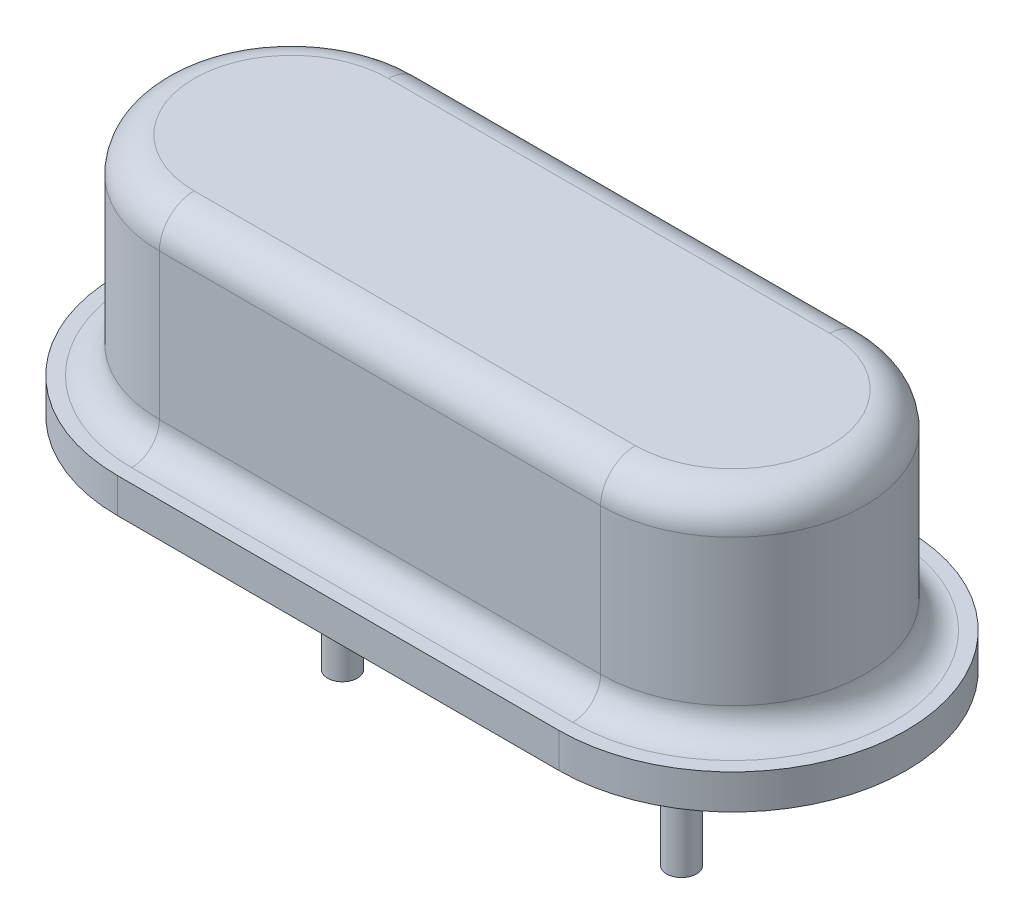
ISO-10303-21;
HEADER;
FILE_DESCRIPTION(('STEP AP214'),'2;1');
FILE_NAME('part.step','',(''),(''),'','','');
FILE_SCHEMA(('AUTOMOTIVE_DESIGN { 1 0 10303 214 1 1 1 1 }'));
ENDSEC;
DATA;
#1=APPLICATION_CONTEXT('core data for automotive mechanical design processes');
#2=APPLICATION_PROTOCOL_DEFINITION('international standard','automotive_design',2000,#1);
#3=PRODUCT_CONTEXT('',#1,'mechanical');
#4=PRODUCT('Part','Part','',(#3));
#5=PRODUCT_RELATED_PRODUCT_CATEGORY('part','',(#4));
#6=PRODUCT_DEFINITION_FORMATION('','',#4);
#7=PRODUCT_DEFINITION_CONTEXT('part definition',#1,'design');
#8=PRODUCT_DEFINITION('design','',#6,#7);
#9=PRODUCT_DEFINITION_SHAPE('','',#8);
#10=(LENGTH_UNIT() NAMED_UNIT(*) SI_UNIT(.MILLI.,.METRE.));
#11=(NAMED_UNIT(*) PLANE_ANGLE_UNIT() SI_UNIT($,.RADIAN.));
#12=(NAMED_UNIT(*) SI_UNIT($,.STERADIAN.) SOLID_ANGLE_UNIT());
#13=UNCERTAINTY_MEASURE_WITH_UNIT(LENGTH_MEASURE(1.E-05),#10,'distance_accuracy_value','');
#14=(GEOMETRIC_REPRESENTATION_CONTEXT(3) GLOBAL_UNCERTAINTY_ASSIGNED_CONTEXT((#13)) GLOBAL_UNIT_ASSIGNED_CONTEXT((#10,
#11,#12)) REPRESENTATION_CONTEXT('',''));
#15=CARTESIAN_POINT('',(0.,0.,0.));
#16=DIRECTION('',(0.,0.,1.));
#17=DIRECTION('',(1.,0.,0.));
#18=AXIS2_PLACEMENT_3D('',#15,#16,#17);
#19=CARTESIAN_POINT('',(-0.734999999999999,0.8,0.));
#20=DIRECTION('',(0.,-1.,0.));
#21=DIRECTION('',(0.,0.,-1.));
#22=AXIS2_PLACEMENT_3D('',#19,#20,#21);
#23=PLANE('',#22);
#24=DIRECTION('',(1.,0.,0.));
#25=VECTOR('',#24,1.);
#26=CARTESIAN_POINT('',(-0.734999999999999,0.8,2.3));
#27=LINE('',#26,#25);
#28=CARTESIAN_POINT('',(5.615,0.8,2.3));
#29=VERTEX_POINT('',#28);
#30=CARTESIAN_POINT('',(-0.734999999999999,0.8,2.3));
#31=VERTEX_POINT('',#30);
#32=EDGE_CURVE('E210',#29,#31,#27,.F.);
#33=ORIENTED_EDGE('',*,*,#32,.T.);
#34=CARTESIAN_POINT('',(-0.734999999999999,0.8,0.));
#35=DIRECTION('',(0.,-1.,0.));
#36=DIRECTION('',(0.,0.,-1.));
#37=AXIS2_PLACEMENT_3D('',#34,#35,#36);
#38=CIRCLE('',#37,2.3);
#39=CARTESIAN_POINT('',(-0.735,0.8,-2.3));
#40=VERTEX_POINT('',#39);
#41=EDGE_CURVE('E218',#31,#40,#38,.T.);
#42=ORIENTED_EDGE('',*,*,#41,.T.);
#43=DIRECTION('',(-1.,0.,0.));
#44=VECTOR('',#43,1.);
#45=CARTESIAN_POINT('',(5.615,0.8,-2.3));
#46=LINE('',#45,#44);
#47=CARTESIAN_POINT('',(5.615,0.8,-2.3));
#48=VERTEX_POINT('',#47);
#49=EDGE_CURVE('E216',#40,#48,#46,.F.);
#50=ORIENTED_EDGE('',*,*,#49,.T.);
#51=CARTESIAN_POINT('',(5.615,0.8,0.));
#52=DIRECTION('',(0.,-1.,0.));
#53=DIRECTION('',(0.,0.,-1.));
#54=AXIS2_PLACEMENT_3D('',#51,#52,#53);
#55=CIRCLE('',#54,2.3);
#56=EDGE_CURVE('E213',#48,#29,#55,.T.);
#57=ORIENTED_EDGE('',*,*,#56,.T.);
#58=EDGE_LOOP('',(#33,#42,#50,#57));
#59=FACE_BOUND('',#58,.T.);
#60=CARTESIAN_POINT('',(-0.734999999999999,0.8,0.));
#61=DIRECTION('',(0.,1.,0.));
#62=DIRECTION('',(0.,0.,-1.));
#63=AXIS2_PLACEMENT_3D('',#60,#61,#62);
#64=CIRCLE('',#63,2.5);
#65=CARTESIAN_POINT('',(-0.734999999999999,0.8,-2.5));
#66=VERTEX_POINT('',#65);
#67=CARTESIAN_POINT('',(-0.734999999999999,0.8,2.5));
#68=VERTEX_POINT('',#67);
#69=EDGE_CURVE('E168',#66,#68,#64,.T.);
#70=ORIENTED_EDGE('',*,*,#69,.T.);
#71=DIRECTION('',(1.,0.,0.));
#72=VECTOR('',#71,1.);
#73=CARTESIAN_POINT('',(-0.734999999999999,0.8,2.5));
#74=LINE('',#73,#72);
#75=CARTESIAN_POINT('',(5.615,0.8,2.5));
#76=VERTEX_POINT('',#75);
#77=EDGE_CURVE('E141',#68,#76,#74,.T.);
#78=ORIENTED_EDGE('',*,*,#77,.T.);
#79=CARTESIAN_POINT('',(5.615,0.8,0.));
#80=DIRECTION('',(0.,1.,0.));
#81=DIRECTION('',(0.,0.,1.));
#82=AXIS2_PLACEMENT_3D('',#79,#80,#81);
#83=CIRCLE('',#82,2.5);
#84=CARTESIAN_POINT('',(5.615,0.8,-2.5));
#85=VERTEX_POINT('',#84);
#86=EDGE_CURVE('E173',#76,#85,#83,.T.);
#87=ORIENTED_EDGE('',*,*,#86,.T.);
#88=DIRECTION('',(-1.,0.,0.));
#89=VECTOR('',#88,1.);
#90=CARTESIAN_POINT('',(-0.734999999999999,0.8,-2.5));
#91=LINE('',#90,#89);
#92=EDGE_CURVE('E176',#85,#66,#91,.T.);
#93=ORIENTED_EDGE('',*,*,#92,.T.);
#94=EDGE_LOOP('',(#70,#78,#87,#93));
#95=FACE_BOUND('',#94,.T.);
#96=ADVANCED_FACE('F38',(#59,#95),#23,.F.);
#97=CARTESIAN_POINT('',(0.,-2.5,0.));
#98=DIRECTION('',(0.,-1.,0.));
#99=DIRECTION('',(1.,0.,0.));
#100=AXIS2_PLACEMENT_3D('',#97,#98,#99);
#101=PLANE('',#100);
#102=CARTESIAN_POINT('',(0.,-2.5,0.));
#103=DIRECTION('',(0.,-1.,0.));
#104=DIRECTION('',(1.,0.,0.));
#105=AXIS2_PLACEMENT_3D('',#102,#103,#104);
#106=CIRCLE('',#105,0.215);
#107=CARTESIAN_POINT('',(0.215,-2.5,0.));
#108=VERTEX_POINT('',#107);
#109=EDGE_CURVE('E198',#108,#108,#106,.T.);
#110=ORIENTED_EDGE('',*,*,#109,.T.);
#111=EDGE_LOOP('',(#110));
#112=FACE_BOUND('',#111,.T.);
#113=ADVANCED_FACE('F40',(#112),#101,.T.);
#114=CARTESIAN_POINT('',(0.,-2.5,0.));
#115=DIRECTION('',(0.,-1.,0.));
#116=DIRECTION('',(1.,0.,0.));
#117=AXIS2_PLACEMENT_3D('',#114,#115,#116);
#118=CYLINDRICAL_SURFACE('',#117,0.215);
#119=CARTESIAN_POINT('',(0.,0.,0.));
#120=DIRECTION('',(0.,-1.,0.));
#121=DIRECTION('',(1.,0.,0.));
#122=AXIS2_PLACEMENT_3D('',#119,#120,#121);
#123=CIRCLE('',#122,0.215);
#124=CARTESIAN_POINT('',(0.215,0.,0.));
#125=VERTEX_POINT('',#124);
#126=EDGE_CURVE('E194',#125,#125,#123,.T.);
#127=ORIENTED_EDGE('',*,*,#126,.T.);
#128=EDGE_LOOP('',(#127));
#129=FACE_BOUND('',#128,.T.);
#130=ORIENTED_EDGE('',*,*,#109,.F.);
#131=EDGE_LOOP('',(#130));
#132=FACE_BOUND('',#131,.T.);
#133=ADVANCED_FACE('F367',(#129,#132),#118,.T.);
#134=CARTESIAN_POINT('',(0.215,0.,0.));
#135=DIRECTION('',(0.,-1.,0.));
#136=DIRECTION('',(1.,0.,0.));
#137=AXIS2_PLACEMENT_3D('',#134,#135,#136);
#138=PLANE('',#137);
#139=CARTESIAN_POINT('',(0.,0.,0.));
#140=DIRECTION('',(0.,-1.,0.));
#141=DIRECTION('',(1.,0.,0.));
#142=AXIS2_PLACEMENT_3D('',#139,#140,#141);
#143=CIRCLE('',#142,0.312701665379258);
#144=CARTESIAN_POINT('',(0.312701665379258,0.,0.));
#145=VERTEX_POINT('',#144);
#146=EDGE_CURVE('E190',#145,#145,#143,.T.);
#147=ORIENTED_EDGE('',*,*,#146,.T.);
#148=EDGE_LOOP('',(#147));
#149=FACE_BOUND('',#148,.T.);
#150=ORIENTED_EDGE('',*,*,#126,.F.);
#151=EDGE_LOOP('',(#150));
#152=FACE_BOUND('',#151,.T.);
#153=ADVANCED_FACE('F385',(#149,#152),#138,.T.);
#154=CARTESIAN_POINT('',(0.,0.4,0.));
#155=DIRECTION('',(0.,-1.,0.));
#156=DIRECTION('',(1.,0.,0.));
#157=AXIS2_PLACEMENT_3D('',#154,#155,#156);
#158=DEGENERATE_TOROIDAL_SURFACE('',#157,0.312701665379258,0.4,.T.);
#159=CARTESIAN_POINT('',(0.,0.3,0.));
#160=DIRECTION('',(0.,-1.,0.));
#161=DIRECTION('',(0.,0.,-1.));
#162=AXIS2_PLACEMENT_3D('',#159,#160,#161);
#163=CIRCLE('',#162,0.7);
#164=CARTESIAN_POINT('',(0.,0.3,-0.7));
#165=VERTEX_POINT('',#164);
#166=EDGE_CURVE('E146',#165,#165,#163,.F.);
#167=ORIENTED_EDGE('',*,*,#166,.F.);
#168=EDGE_LOOP('',(#167));
#169=FACE_BOUND('',#168,.T.);
#170=ORIENTED_EDGE('',*,*,#146,.F.);
#171=EDGE_LOOP('',(#170));
#172=FACE_BOUND('',#171,.T.);
#173=ADVANCED_FACE('F382',(#169,#172),#158,.T.);
#174=CARTESIAN_POINT('',(-0.734999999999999,0.8,0.));
#175=DIRECTION('',(0.,-1.,0.));
#176=DIRECTION('',(0.,0.,-1.));
#177=AXIS2_PLACEMENT_3D('',#174,#175,#176);
#178=CYLINDRICAL_SURFACE('',#177,2.5);
#179=CARTESIAN_POINT('',(-0.734999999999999,0.3,0.));
#180=DIRECTION('',(0.,1.,0.));
#181=DIRECTION('',(0.,0.,-1.));
#182=AXIS2_PLACEMENT_3D('',#179,#180,#181);
#183=CIRCLE('',#182,2.5);
#184=CARTESIAN_POINT('',(-0.734999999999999,0.3,-2.5));
#185=VERTEX_POINT('',#184);
#186=CARTESIAN_POINT('',(-0.734999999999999,0.3,2.5));
#187=VERTEX_POINT('',#186);
#188=EDGE_CURVE('E131',#185,#187,#183,.T.);
#189=ORIENTED_EDGE('',*,*,#188,.T.);
#190=DIRECTION('',(0.,-1.,0.));
#191=VECTOR('',#190,1.);
#192=CARTESIAN_POINT('',(-0.734999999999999,0.8,2.5));
#193=LINE('',#192,#191);
#194=EDGE_CURVE('E139',#68,#187,#193,.T.);
#195=ORIENTED_EDGE('',*,*,#194,.F.);
#196=ORIENTED_EDGE('',*,*,#69,.F.);
#197=DIRECTION('',(0.,-1.,0.));
#198=VECTOR('',#197,1.);
#199=CARTESIAN_POINT('',(-0.734999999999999,0.8,-2.5));
#200=LINE('',#199,#198);
#201=EDGE_CURVE('E152',#66,#185,#200,.T.);
#202=ORIENTED_EDGE('',*,*,#201,.T.);
#203=EDGE_LOOP('',(#189,#195,#196,#202));
#204=FACE_BOUND('',#203,.T.);
#205=ADVANCED_FACE('F150',(#204),#178,.T.);
#206=CARTESIAN_POINT('',(-0.734999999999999,0.8,2.5));
#207=DIRECTION('',(0.,0.,-1.));
#208=DIRECTION('',(-1.,0.,0.));
#209=AXIS2_PLACEMENT_3D('',#206,#207,#208);
#210=PLANE('',#209);
#211=DIRECTION('',(1.,0.,0.));
#212=VECTOR('',#211,1.);
#213=CARTESIAN_POINT('',(-0.734999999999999,0.3,2.5));
#214=LINE('',#213,#212);
#215=CARTESIAN_POINT('',(5.615,0.3,2.5));
#216=VERTEX_POINT('',#215);
#217=EDGE_CURVE('E126',#187,#216,#214,.T.);
#218=ORIENTED_EDGE('',*,*,#217,.T.);
#219=DIRECTION('',(0.,-1.,0.));
#220=VECTOR('',#219,1.);
#221=CARTESIAN_POINT('',(5.615,0.8,2.5));
#222=LINE('',#221,#220);
#223=EDGE_CURVE('E147',#76,#216,#222,.T.);
#224=ORIENTED_EDGE('',*,*,#223,.F.);
#225=ORIENTED_EDGE('',*,*,#77,.F.);
#226=ORIENTED_EDGE('',*,*,#194,.T.);
#227=EDGE_LOOP('',(#218,#224,#225,#226));
#228=FACE_BOUND('',#227,.T.);
#229=ADVANCED_FACE('F140',(#228),#210,.F.);
#230=CARTESIAN_POINT('',(5.615,0.8,0.));
#231=DIRECTION('',(0.,-1.,0.));
#232=DIRECTION('',(0.,0.,-1.));
#233=AXIS2_PLACEMENT_3D('',#230,#231,#232);
#234=CYLINDRICAL_SURFACE('',#233,2.5);
#235=CARTESIAN_POINT('',(5.615,0.3,0.));
#236=DIRECTION('',(0.,1.,0.));
#237=DIRECTION('',(0.,0.,1.));
#238=AXIS2_PLACEMENT_3D('',#235,#236,#237);
#239=CIRCLE('',#238,2.5);
#240=CARTESIAN_POINT('',(5.615,0.3,-2.5));
#241=VERTEX_POINT('',#240);
#242=EDGE_CURVE('E132',#216,#241,#239,.T.);
#243=ORIENTED_EDGE('',*,*,#242,.T.);
#244=DIRECTION('',(0.,-1.,0.));
#245=VECTOR('',#244,1.);
#246=CARTESIAN_POINT('',(5.615,0.8,-2.5));
#247=LINE('',#246,#245);
#248=EDGE_CURVE('E181',#85,#241,#247,.T.);
#249=ORIENTED_EDGE('',*,*,#248,.F.);
#250=ORIENTED_EDGE('',*,*,#86,.F.);
#251=ORIENTED_EDGE('',*,*,#223,.T.);
#252=EDGE_LOOP('',(#243,#249,#250,#251));
#253=FACE_BOUND('',#252,.T.);
#254=ADVANCED_FACE('F373',(#253),#234,.T.);
#255=CARTESIAN_POINT('',(-0.734999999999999,0.8,-2.5));
#256=DIRECTION('',(0.,0.,1.));
#257=DIRECTION('',(1.,0.,0.));
#258=AXIS2_PLACEMENT_3D('',#255,#256,#257);
#259=PLANE('',#258);
#260=DIRECTION('',(-1.,0.,0.));
#261=VECTOR('',#260,1.);
#262=CARTESIAN_POINT('',(-0.734999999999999,0.3,-2.5));
#263=LINE('',#262,#261);
#264=EDGE_CURVE('E165',#241,#185,#263,.T.);
#265=ORIENTED_EDGE('',*,*,#264,.T.);
#266=ORIENTED_EDGE('',*,*,#201,.F.);
#267=ORIENTED_EDGE('',*,*,#92,.F.);
#268=ORIENTED_EDGE('',*,*,#248,.T.);
#269=EDGE_LOOP('',(#265,#266,#267,#268));
#270=FACE_BOUND('',#269,.T.);
#271=ADVANCED_FACE('F370',(#270),#259,.F.);
#272=CARTESIAN_POINT('',(-0.734999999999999,0.3,0.));
#273=DIRECTION('',(0.,-1.,0.));
#274=DIRECTION('',(0.,0.,-1.));
#275=AXIS2_PLACEMENT_3D('',#272,#273,#274);
#276=PLANE('',#275);
#277=CARTESIAN_POINT('',(4.88,0.3,0.));
#278=DIRECTION('',(0.,-1.,0.));
#279=DIRECTION('',(0.,0.,-1.));
#280=AXIS2_PLACEMENT_3D('',#277,#278,#279);
#281=CIRCLE('',#280,0.7);
#282=CARTESIAN_POINT('',(4.88,0.3,-0.7));
#283=VERTEX_POINT('',#282);
#284=EDGE_CURVE('E202',#283,#283,#281,.T.);
#285=ORIENTED_EDGE('',*,*,#284,.F.);
#286=EDGE_LOOP('',(#285));
#287=FACE_BOUND('',#286,.T.);
#288=ORIENTED_EDGE('',*,*,#166,.T.);
#289=EDGE_LOOP('',(#288));
#290=FACE_BOUND('',#289,.T.);
#291=ORIENTED_EDGE('',*,*,#188,.F.);
#292=ORIENTED_EDGE('',*,*,#264,.F.);
#293=ORIENTED_EDGE('',*,*,#242,.F.);
#294=ORIENTED_EDGE('',*,*,#217,.F.);
#295=EDGE_LOOP('',(#291,#292,#293,#294));
#296=FACE_BOUND('',#295,.T.);
#297=ADVANCED_FACE('F128',(#287,#290,#296),#276,.T.);
#298=CARTESIAN_POINT('',(5.615,18.1380118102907,-1.9));
#299=DIRECTION('',(0.,0.,1.));
#300=DIRECTION('',(1.,0.,0.));
#301=AXIS2_PLACEMENT_3D('',#298,#299,#300);
#302=PLANE('',#301);
#303=DIRECTION('',(0.,-1.,0.));
#304=VECTOR('',#303,1.);
#305=CARTESIAN_POINT('',(-0.734999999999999,18.1380118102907,-1.9));
#306=LINE('',#305,#304);
#307=CARTESIAN_POINT('',(-0.734999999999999,3.3,-1.9));
#308=VERTEX_POINT('',#307);
#309=CARTESIAN_POINT('',(-0.734999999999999,1.20000000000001,-1.9));
#310=VERTEX_POINT('',#309);
#311=EDGE_CURVE('E267',#308,#310,#306,.T.);
#312=ORIENTED_EDGE('',*,*,#311,.F.);
#313=DIRECTION('',(1.,0.,0.));
#314=VECTOR('',#313,1.);
#315=CARTESIAN_POINT('',(5.615,3.3,-1.9));
#316=LINE('',#315,#314);
#317=CARTESIAN_POINT('',(5.615,3.3,-1.9));
#318=VERTEX_POINT('',#317);
#319=EDGE_CURVE('E251',#308,#318,#316,.T.);
#320=ORIENTED_EDGE('',*,*,#319,.T.);
#321=DIRECTION('',(0.,-1.,0.));
#322=VECTOR('',#321,1.);
#323=CARTESIAN_POINT('',(5.615,18.1380118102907,-1.9));
#324=LINE('',#323,#322);
#325=CARTESIAN_POINT('',(5.615,1.20000000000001,-1.9));
#326=VERTEX_POINT('',#325);
#327=EDGE_CURVE('E268',#318,#326,#324,.T.);
#328=ORIENTED_EDGE('',*,*,#327,.T.);
#329=DIRECTION('',(-1.,0.,0.));
#330=VECTOR('',#329,1.);
#331=CARTESIAN_POINT('',(-0.735,1.2,-1.9));
#332=LINE('',#331,#330);
#333=EDGE_CURVE('E222',#326,#310,#332,.T.);
#334=ORIENTED_EDGE('',*,*,#333,.T.);
#335=EDGE_LOOP('',(#312,#320,#328,#334));
#336=FACE_BOUND('',#335,.T.);
#337=ADVANCED_FACE('F350',(#336),#302,.F.);
#338=CARTESIAN_POINT('',(5.615,18.1380118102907,0.));
#339=DIRECTION('',(0.,-1.,0.));
#340=DIRECTION('',(0.,0.,-1.));
#341=AXIS2_PLACEMENT_3D('',#338,#339,#340);
#342=CYLINDRICAL_SURFACE('',#341,1.9);
#343=ORIENTED_EDGE('',*,*,#327,.F.);
#344=CARTESIAN_POINT('',(5.615,3.3,0.));
#345=DIRECTION('',(0.,-1.,0.));
#346=DIRECTION('',(0.,0.,-1.));
#347=AXIS2_PLACEMENT_3D('',#344,#345,#346);
#348=CIRCLE('',#347,1.9);
#349=CARTESIAN_POINT('',(5.615,3.3,1.9));
#350=VERTEX_POINT('',#349);
#351=EDGE_CURVE('E234',#318,#350,#348,.T.);
#352=ORIENTED_EDGE('',*,*,#351,.T.);
#353=DIRECTION('',(0.,-1.,0.));
#354=VECTOR('',#353,1.);
#355=CARTESIAN_POINT('',(5.615,18.1380118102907,1.9));
#356=LINE('',#355,#354);
#357=CARTESIAN_POINT('',(5.615,1.20000000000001,1.9));
#358=VERTEX_POINT('',#357);
#359=EDGE_CURVE('E159',#350,#358,#356,.T.);
#360=ORIENTED_EDGE('',*,*,#359,.T.);
#361=CARTESIAN_POINT('',(5.615,1.2,0.));
#362=DIRECTION('',(0.,-1.,0.));
#363=DIRECTION('',(0.,0.,-1.));
#364=AXIS2_PLACEMENT_3D('',#361,#362,#363);
#365=CIRCLE('',#364,1.9);
#366=EDGE_CURVE('E226',#358,#326,#365,.F.);
#367=ORIENTED_EDGE('',*,*,#366,.T.);
#368=EDGE_LOOP('',(#343,#352,#360,#367));
#369=FACE_BOUND('',#368,.T.);
#370=ADVANCED_FACE('F325',(#369),#342,.T.);
#371=CARTESIAN_POINT('',(-0.734999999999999,18.1380118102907,1.9));
#372=DIRECTION('',(0.,0.,-1.));
#373=DIRECTION('',(-1.,0.,0.));
#374=AXIS2_PLACEMENT_3D('',#371,#372,#373);
#375=PLANE('',#374);
#376=ORIENTED_EDGE('',*,*,#359,.F.);
#377=DIRECTION('',(-1.,0.,0.));
#378=VECTOR('',#377,1.);
#379=CARTESIAN_POINT('',(-0.734999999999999,3.3,1.9));
#380=LINE('',#379,#378);
#381=CARTESIAN_POINT('',(-0.734999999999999,3.3,1.9));
#382=VERTEX_POINT('',#381);
#383=EDGE_CURVE('E12',#350,#382,#380,.T.);
#384=ORIENTED_EDGE('',*,*,#383,.T.);
#385=DIRECTION('',(0.,-1.,0.));
#386=VECTOR('',#385,1.);
#387=CARTESIAN_POINT('',(-0.734999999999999,18.1380118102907,1.9));
#388=LINE('',#387,#386);
#389=CARTESIAN_POINT('',(-0.734999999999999,1.20000000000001,1.9));
#390=VERTEX_POINT('',#389);
#391=EDGE_CURVE('E154',#382,#390,#388,.T.);
#392=ORIENTED_EDGE('',*,*,#391,.T.);
#393=DIRECTION('',(1.,0.,0.));
#394=VECTOR('',#393,1.);
#395=CARTESIAN_POINT('',(5.615,1.2,1.9));
#396=LINE('',#395,#394);
#397=EDGE_CURVE('E230',#390,#358,#396,.T.);
#398=ORIENTED_EDGE('',*,*,#397,.T.);
#399=EDGE_LOOP('',(#376,#384,#392,#398));
#400=FACE_BOUND('',#399,.T.);
#401=ADVANCED_FACE('F326',(#400),#375,.F.);
#402=CARTESIAN_POINT('',(-0.734999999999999,18.1380118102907,0.));
#403=DIRECTION('',(0.,-1.,0.));
#404=DIRECTION('',(0.,0.,-1.));
#405=AXIS2_PLACEMENT_3D('',#402,#403,#404);
#406=CYLINDRICAL_SURFACE('',#405,1.9);
#407=ORIENTED_EDGE('',*,*,#391,.F.);
#408=CARTESIAN_POINT('',(-0.734999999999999,3.3,0.));
#409=DIRECTION('',(0.,-1.,0.));
#410=DIRECTION('',(0.,0.,-1.));
#411=AXIS2_PLACEMENT_3D('',#408,#409,#410);
#412=CIRCLE('',#411,1.9);
#413=EDGE_CURVE('E47',#382,#308,#412,.T.);
#414=ORIENTED_EDGE('',*,*,#413,.T.);
#415=ORIENTED_EDGE('',*,*,#311,.T.);
#416=CARTESIAN_POINT('',(-0.734999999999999,1.2,0.));
#417=DIRECTION('',(0.,-1.,0.));
#418=DIRECTION('',(0.,0.,-1.));
#419=AXIS2_PLACEMENT_3D('',#416,#417,#418);
#420=CIRCLE('',#419,1.9);
#421=EDGE_CURVE('E206',#310,#390,#420,.F.);
#422=ORIENTED_EDGE('',*,*,#421,.T.);
#423=EDGE_LOOP('',(#407,#414,#415,#422));
#424=FACE_BOUND('',#423,.T.);
#425=ADVANCED_FACE('F351',(#424),#406,.T.);
#426=CARTESIAN_POINT('',(-0.734999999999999,3.8,0.));
#427=DIRECTION('',(0.,-1.,0.));
#428=DIRECTION('',(0.,0.,-1.));
#429=AXIS2_PLACEMENT_3D('',#426,#427,#428);
#430=PLANE('',#429);
#431=DIRECTION('',(-1.,0.,0.));
#432=VECTOR('',#431,1.);
#433=CARTESIAN_POINT('',(-0.734999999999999,3.8,1.4));
#434=LINE('',#433,#432);
#435=CARTESIAN_POINT('',(-0.734999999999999,3.8,1.4));
#436=VERTEX_POINT('',#435);
#437=CARTESIAN_POINT('',(5.615,3.8,1.4));
#438=VERTEX_POINT('',#437);
#439=EDGE_CURVE('E238',#436,#438,#434,.F.);
#440=ORIENTED_EDGE('',*,*,#439,.T.);
#441=CARTESIAN_POINT('',(5.615,3.8,0.));
#442=DIRECTION('',(0.,-1.,0.));
#443=DIRECTION('',(0.,0.,-1.));
#444=AXIS2_PLACEMENT_3D('',#441,#442,#443);
#445=CIRCLE('',#444,1.4);
#446=CARTESIAN_POINT('',(5.615,3.8,-1.4));
#447=VERTEX_POINT('',#446);
#448=EDGE_CURVE('E247',#438,#447,#445,.F.);
#449=ORIENTED_EDGE('',*,*,#448,.T.);
#450=DIRECTION('',(1.,0.,0.));
#451=VECTOR('',#450,1.);
#452=CARTESIAN_POINT('',(-0.734999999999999,3.8,-1.4));
#453=LINE('',#452,#451);
#454=CARTESIAN_POINT('',(-0.734999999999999,3.8,-1.4));
#455=VERTEX_POINT('',#454);
#456=EDGE_CURVE('E244',#447,#455,#453,.F.);
#457=ORIENTED_EDGE('',*,*,#456,.T.);
#458=CARTESIAN_POINT('',(-0.734999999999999,3.8,0.));
#459=DIRECTION('',(0.,-1.,0.));
#460=DIRECTION('',(0.,0.,-1.));
#461=AXIS2_PLACEMENT_3D('',#458,#459,#460);
#462=CIRCLE('',#461,1.4);
#463=EDGE_CURVE('E241',#455,#436,#462,.F.);
#464=ORIENTED_EDGE('',*,*,#463,.T.);
#465=EDGE_LOOP('',(#440,#449,#457,#464));
#466=FACE_BOUND('',#465,.T.);
#467=ADVANCED_FACE('F315',(#466),#430,.F.);
#468=CARTESIAN_POINT('',(4.88,-2.5,0.));
#469=DIRECTION('',(0.,-1.,0.));
#470=DIRECTION('',(-1.,0.,0.));
#471=AXIS2_PLACEMENT_3D('',#468,#469,#470);
#472=PLANE('',#471);
#473=CARTESIAN_POINT('',(4.88,-2.5,0.));
#474=DIRECTION('',(0.,1.,0.));
#475=DIRECTION('',(-1.,0.,0.));
#476=AXIS2_PLACEMENT_3D('',#473,#474,#475);
#477=CIRCLE('',#476,0.215);
#478=CARTESIAN_POINT('',(4.665,-2.5,0.));
#479=VERTEX_POINT('',#478);
#480=EDGE_CURVE('E269',#479,#479,#477,.T.);
#481=ORIENTED_EDGE('',*,*,#480,.F.);
#482=EDGE_LOOP('',(#481));
#483=FACE_BOUND('',#482,.T.);
#484=ADVANCED_FACE('F358',(#483),#472,.T.);
#485=CARTESIAN_POINT('',(4.88,-2.5,0.));
#486=DIRECTION('',(0.,-1.,0.));
#487=DIRECTION('',(-1.,0.,0.));
#488=AXIS2_PLACEMENT_3D('',#485,#486,#487);
#489=CYLINDRICAL_SURFACE('',#488,0.215);
#490=CARTESIAN_POINT('',(4.88,0.,0.));
#491=DIRECTION('',(0.,1.,0.));
#492=DIRECTION('',(-1.,0.,0.));
#493=AXIS2_PLACEMENT_3D('',#490,#491,#492);
#494=CIRCLE('',#493,0.215);
#495=CARTESIAN_POINT('',(4.665,0.,0.));
#496=VERTEX_POINT('',#495);
#497=EDGE_CURVE('E278',#496,#496,#494,.T.);
#498=ORIENTED_EDGE('',*,*,#497,.F.);
#499=EDGE_LOOP('',(#498));
#500=FACE_BOUND('',#499,.T.);
#501=ORIENTED_EDGE('',*,*,#480,.T.);
#502=EDGE_LOOP('',(#501));
#503=FACE_BOUND('',#502,.T.);
#504=ADVANCED_FACE('F451',(#500,#503),#489,.T.);
#505=CARTESIAN_POINT('',(4.665,0.,0.));
#506=DIRECTION('',(0.,-1.,0.));
#507=DIRECTION('',(-1.,0.,0.));
#508=AXIS2_PLACEMENT_3D('',#505,#506,#507);
#509=PLANE('',#508);
#510=CARTESIAN_POINT('',(4.88,0.,0.));
#511=DIRECTION('',(0.,1.,0.));
#512=DIRECTION('',(-1.,0.,0.));
#513=AXIS2_PLACEMENT_3D('',#510,#511,#512);
#514=CIRCLE('',#513,0.312701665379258);
#515=CARTESIAN_POINT('',(4.56729833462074,0.,0.));
#516=VERTEX_POINT('',#515);
#517=EDGE_CURVE('E282',#516,#516,#514,.T.);
#518=ORIENTED_EDGE('',*,*,#517,.F.);
#519=EDGE_LOOP('',(#518));
#520=FACE_BOUND('',#519,.T.);
#521=ORIENTED_EDGE('',*,*,#497,.T.);
#522=EDGE_LOOP('',(#521));
#523=FACE_BOUND('',#522,.T.);
#524=ADVANCED_FACE('F460',(#520,#523),#509,.T.);
#525=CARTESIAN_POINT('',(4.88,0.4,0.));
#526=DIRECTION('',(0.,-1.,0.));
#527=DIRECTION('',(-1.,0.,0.));
#528=AXIS2_PLACEMENT_3D('',#525,#526,#527);
#529=DEGENERATE_TOROIDAL_SURFACE('',#528,0.312701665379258,0.4,.T.);
#530=ORIENTED_EDGE('',*,*,#284,.T.);
#531=EDGE_LOOP('',(#530));
#532=FACE_BOUND('',#531,.T.);
#533=ORIENTED_EDGE('',*,*,#517,.T.);
#534=EDGE_LOOP('',(#533));
#535=FACE_BOUND('',#534,.T.);
#536=ADVANCED_FACE('F469',(#532,#535),#529,.T.);
#537=CARTESIAN_POINT('',(5.615,1.2,0.));
#538=DIRECTION('',(0.,-1.,0.));
#539=DIRECTION('',(0.,0.,-1.));
#540=AXIS2_PLACEMENT_3D('',#537,#538,#539);
#541=TOROIDAL_SURFACE('',#540,2.3,0.4);
#542=CARTESIAN_POINT('',(5.615,1.2,2.3));
#543=DIRECTION('',(1.,0.,0.));
#544=DIRECTION('',(0.,0.,-1.));
#545=AXIS2_PLACEMENT_3D('',#542,#543,#544);
#546=CIRCLE('',#545,0.4);
#547=EDGE_CURVE('E260',#29,#358,#546,.T.);
#548=ORIENTED_EDGE('',*,*,#547,.F.);
#549=ORIENTED_EDGE('',*,*,#56,.F.);
#550=CARTESIAN_POINT('',(5.615,1.2,-2.3));
#551=DIRECTION('',(1.,0.,0.));
#552=DIRECTION('',(0.,0.,-1.));
#553=AXIS2_PLACEMENT_3D('',#550,#551,#552);
#554=CIRCLE('',#553,0.4);
#555=EDGE_CURVE('E288',#326,#48,#554,.T.);
#556=ORIENTED_EDGE('',*,*,#555,.F.);
#557=ORIENTED_EDGE('',*,*,#366,.F.);
#558=EDGE_LOOP('',(#548,#549,#556,#557));
#559=FACE_BOUND('',#558,.T.);
#560=ADVANCED_FACE('F334',(#559),#541,.F.);
#561=CARTESIAN_POINT('',(5.615,1.2,-2.3));
#562=DIRECTION('',(1.,0.,0.));
#563=DIRECTION('',(0.,0.,-1.));
#564=AXIS2_PLACEMENT_3D('',#561,#562,#563);
#565=CYLINDRICAL_SURFACE('',#564,0.4);
#566=ORIENTED_EDGE('',*,*,#555,.T.);
#567=ORIENTED_EDGE('',*,*,#49,.F.);
#568=CARTESIAN_POINT('',(-0.734999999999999,1.2,-2.3));
#569=DIRECTION('',(1.,0.,0.));
#570=DIRECTION('',(0.,1.,0.));
#571=AXIS2_PLACEMENT_3D('',#568,#569,#570);
#572=CIRCLE('',#571,0.4);
#573=EDGE_CURVE('E259',#310,#40,#572,.T.);
#574=ORIENTED_EDGE('',*,*,#573,.F.);
#575=ORIENTED_EDGE('',*,*,#333,.F.);
#576=EDGE_LOOP('',(#566,#567,#574,#575));
#577=FACE_BOUND('',#576,.T.);
#578=ADVANCED_FACE('F348',(#577),#565,.F.);
#579=CARTESIAN_POINT('',(-0.734999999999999,1.2,2.3));
#580=DIRECTION('',(-1.,0.,0.));
#581=DIRECTION('',(0.,0.,1.));
#582=AXIS2_PLACEMENT_3D('',#579,#580,#581);
#583=CYLINDRICAL_SURFACE('',#582,0.4);
#584=ORIENTED_EDGE('',*,*,#547,.T.);
#585=ORIENTED_EDGE('',*,*,#397,.F.);
#586=CARTESIAN_POINT('',(-0.734999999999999,1.2,2.3));
#587=DIRECTION('',(1.,0.,0.));
#588=DIRECTION('',(0.,0.,-1.));
#589=AXIS2_PLACEMENT_3D('',#586,#587,#588);
#590=CIRCLE('',#589,0.4);
#591=EDGE_CURVE('E261',#31,#390,#590,.T.);
#592=ORIENTED_EDGE('',*,*,#591,.F.);
#593=ORIENTED_EDGE('',*,*,#32,.F.);
#594=EDGE_LOOP('',(#584,#585,#592,#593));
#595=FACE_BOUND('',#594,.T.);
#596=ADVANCED_FACE('F338',(#595),#583,.F.);
#597=CARTESIAN_POINT('',(-0.734999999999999,1.2,0.));
#598=DIRECTION('',(0.,-1.,0.));
#599=DIRECTION('',(0.,0.,-1.));
#600=AXIS2_PLACEMENT_3D('',#597,#598,#599);
#601=TOROIDAL_SURFACE('',#600,2.3,0.4);
#602=ORIENTED_EDGE('',*,*,#573,.T.);
#603=ORIENTED_EDGE('',*,*,#41,.F.);
#604=ORIENTED_EDGE('',*,*,#591,.T.);
#605=ORIENTED_EDGE('',*,*,#421,.F.);
#606=EDGE_LOOP('',(#602,#603,#604,#605));
#607=FACE_BOUND('',#606,.T.);
#608=ADVANCED_FACE('F343',(#607),#601,.F.);
#609=CARTESIAN_POINT('',(-0.734999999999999,3.3,0.));
#610=DIRECTION('',(0.,-1.,0.));
#611=DIRECTION('',(0.,0.,-1.));
#612=AXIS2_PLACEMENT_3D('',#609,#610,#611);
#613=TOROIDAL_SURFACE('',#612,1.4,0.5);
#614=CARTESIAN_POINT('',(-0.734999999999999,3.3,1.4));
#615=DIRECTION('',(1.,0.,0.));
#616=DIRECTION('',(0.,0.,-1.));
#617=AXIS2_PLACEMENT_3D('',#614,#615,#616);
#618=CIRCLE('',#617,0.5);
#619=EDGE_CURVE('E264',#436,#382,#618,.T.);
#620=ORIENTED_EDGE('',*,*,#619,.F.);
#621=ORIENTED_EDGE('',*,*,#463,.F.);
#622=CARTESIAN_POINT('',(-0.734999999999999,3.3,-1.4));
#623=DIRECTION('',(1.,0.,0.));
#624=DIRECTION('',(0.,0.,-1.));
#625=AXIS2_PLACEMENT_3D('',#622,#623,#624);
#626=CIRCLE('',#625,0.5);
#627=EDGE_CURVE('E273',#308,#455,#626,.T.);
#628=ORIENTED_EDGE('',*,*,#627,.F.);
#629=ORIENTED_EDGE('',*,*,#413,.F.);
#630=EDGE_LOOP('',(#620,#621,#628,#629));
#631=FACE_BOUND('',#630,.T.);
#632=ADVANCED_FACE('F312',(#631),#613,.T.);
#633=CARTESIAN_POINT('',(5.615,3.3,-1.4));
#634=DIRECTION('',(1.,0.,0.));
#635=DIRECTION('',(0.,0.,-1.));
#636=AXIS2_PLACEMENT_3D('',#633,#634,#635);
#637=CYLINDRICAL_SURFACE('',#636,0.5);
#638=ORIENTED_EDGE('',*,*,#627,.T.);
#639=ORIENTED_EDGE('',*,*,#456,.F.);
#640=CARTESIAN_POINT('',(5.615,3.3,-1.4));
#641=DIRECTION('',(1.,0.,0.));
#642=DIRECTION('',(0.,0.,-1.));
#643=AXIS2_PLACEMENT_3D('',#640,#641,#642);
#644=CIRCLE('',#643,0.5);
#645=EDGE_CURVE('E257',#318,#447,#644,.T.);
#646=ORIENTED_EDGE('',*,*,#645,.F.);
#647=ORIENTED_EDGE('',*,*,#319,.F.);
#648=EDGE_LOOP('',(#638,#639,#646,#647));
#649=FACE_BOUND('',#648,.T.);
#650=ADVANCED_FACE('F307',(#649),#637,.T.);
#651=CARTESIAN_POINT('',(-0.734999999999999,3.3,1.4));
#652=DIRECTION('',(-1.,0.,0.));
#653=DIRECTION('',(0.,0.,1.));
#654=AXIS2_PLACEMENT_3D('',#651,#652,#653);
#655=CYLINDRICAL_SURFACE('',#654,0.5);
#656=ORIENTED_EDGE('',*,*,#619,.T.);
#657=ORIENTED_EDGE('',*,*,#383,.F.);
#658=CARTESIAN_POINT('',(5.615,3.3,1.4));
#659=DIRECTION('',(1.,0.,0.));
#660=DIRECTION('',(0.,0.,-1.));
#661=AXIS2_PLACEMENT_3D('',#658,#659,#660);
#662=CIRCLE('',#661,0.5);
#663=EDGE_CURVE('E255',#438,#350,#662,.T.);
#664=ORIENTED_EDGE('',*,*,#663,.F.);
#665=ORIENTED_EDGE('',*,*,#439,.F.);
#666=EDGE_LOOP('',(#656,#657,#664,#665));
#667=FACE_BOUND('',#666,.T.);
#668=ADVANCED_FACE('F322',(#667),#655,.T.);
#669=CARTESIAN_POINT('',(5.615,3.3,0.));
#670=DIRECTION('',(0.,-1.,0.));
#671=DIRECTION('',(0.,0.,-1.));
#672=AXIS2_PLACEMENT_3D('',#669,#670,#671);
#673=TOROIDAL_SURFACE('',#672,1.4,0.5);
#674=ORIENTED_EDGE('',*,*,#645,.T.);
#675=ORIENTED_EDGE('',*,*,#448,.F.);
#676=ORIENTED_EDGE('',*,*,#663,.T.);
#677=ORIENTED_EDGE('',*,*,#351,.F.);
#678=EDGE_LOOP('',(#674,#675,#676,#677));
#679=FACE_BOUND('',#678,.T.);
#680=ADVANCED_FACE('F319',(#679),#673,.T.);
#681=CLOSED_SHELL('',(#96,#113,#133,#153,#173,#205,#229,#254,#271,#297,#337,#370,#401,#425,#467,
#484,#504,#524,#536,#560,#578,#596,#608,#632,#650,#668,#680));
#682=MANIFOLD_SOLID_BREP('B2',#681);
#683=ADVANCED_BREP_SHAPE_REPRESENTATION('',(#18,#682),#14);
#684=SHAPE_DEFINITION_REPRESENTATION(#9,#683);
ENDSEC;
END-ISO-10303-21;
